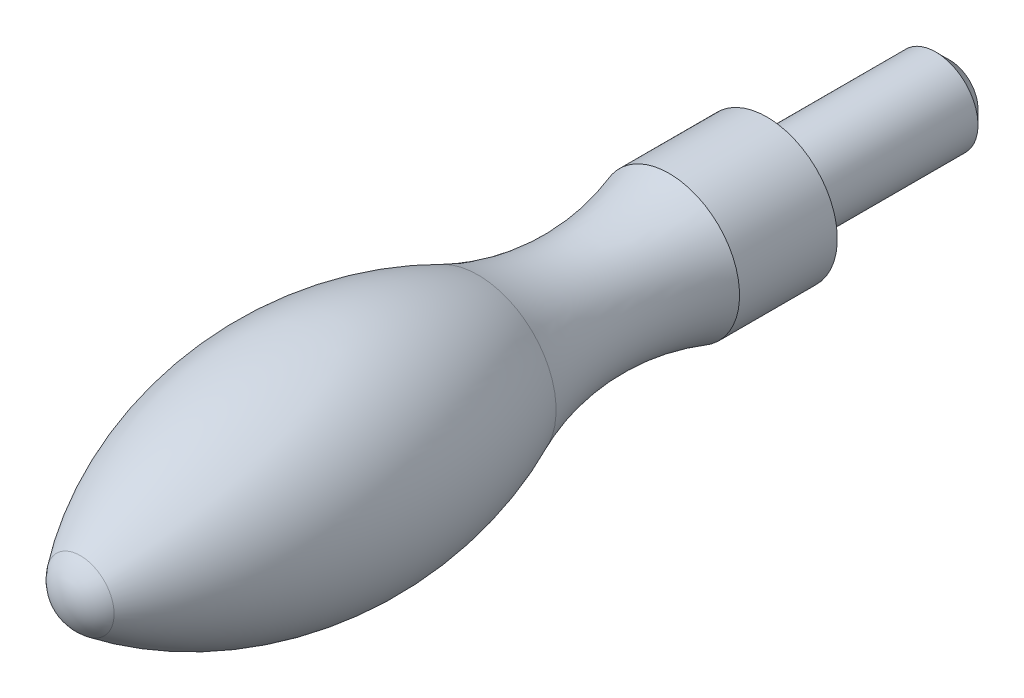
ISO-10303-21;
HEADER;
FILE_DESCRIPTION(('STEP AP214'),'2;1');
FILE_NAME('part.step','',(''),(''),'','','');
FILE_SCHEMA(('AUTOMOTIVE_DESIGN { 1 0 10303 214 1 1 1 1 }'));
ENDSEC;
DATA;
#1=APPLICATION_CONTEXT('core data for automotive mechanical design processes');
#2=APPLICATION_PROTOCOL_DEFINITION('international standard','automotive_design',2000,#1);
#3=PRODUCT_CONTEXT('',#1,'mechanical');
#4=PRODUCT('Part','Part','',(#3));
#5=PRODUCT_RELATED_PRODUCT_CATEGORY('part','',(#4));
#6=PRODUCT_DEFINITION_FORMATION('','',#4);
#7=PRODUCT_DEFINITION_CONTEXT('part definition',#1,'design');
#8=PRODUCT_DEFINITION('design','',#6,#7);
#9=PRODUCT_DEFINITION_SHAPE('','',#8);
#10=(LENGTH_UNIT() NAMED_UNIT(*) SI_UNIT(.MILLI.,.METRE.));
#11=(NAMED_UNIT(*) PLANE_ANGLE_UNIT() SI_UNIT($,.RADIAN.));
#12=(NAMED_UNIT(*) SI_UNIT($,.STERADIAN.) SOLID_ANGLE_UNIT());
#13=UNCERTAINTY_MEASURE_WITH_UNIT(LENGTH_MEASURE(1.E-05),#10,'distance_accuracy_value','');
#14=(GEOMETRIC_REPRESENTATION_CONTEXT(3) GLOBAL_UNCERTAINTY_ASSIGNED_CONTEXT((#13)) GLOBAL_UNIT_ASSIGNED_CONTEXT((#10,
#11,#12)) REPRESENTATION_CONTEXT('',''));
#15=CARTESIAN_POINT('',(0.,0.,0.));
#16=DIRECTION('',(0.,0.,1.));
#17=DIRECTION('',(1.,0.,0.));
#18=AXIS2_PLACEMENT_3D('',#15,#16,#17);
#19=CARTESIAN_POINT('',(0.,0.,47.));
#20=DIRECTION('',(-1.,0.,0.));
#21=DIRECTION('',(0.,0.,1.));
#22=AXIS2_PLACEMENT_3D('',#19,#20,#21);
#23=SPHERICAL_SURFACE('',#22,2.999999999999);
#24=CARTESIAN_POINT('',(0.,0.,47.));
#25=DIRECTION('',(0.,0.,-1.));
#26=DIRECTION('',(-1.,0.,0.));
#27=AXIS2_PLACEMENT_3D('',#24,#25,#26);
#28=SPHERICAL_SURFACE('',#27,2.999999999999);
#29=CARTESIAN_POINT('',(0.,0.,48.8000005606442));
#30=DIRECTION('',(0.,0.,-1.));
#31=DIRECTION('',(-1.,0.,0.));
#32=AXIS2_PLACEMENT_3D('',#29,#30,#31);
#33=CIRCLE('',#32,2.39999957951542);
#34=CARTESIAN_POINT('',(-2.39999957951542,0.,48.8000005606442));
#35=VERTEX_POINT('',#34);
#36=EDGE_CURVE('E23',#35,#35,#33,.T.);
#37=ORIENTED_EDGE('',*,*,#36,.F.);
#38=EDGE_LOOP('',(#37));
#39=FACE_BOUND('',#38,.T.);
#40=ADVANCED_FACE('F12',(#39),#28,.T.);
#41=CARTESIAN_POINT('',(0.,0.,32.));
#42=DIRECTION('',(0.,0.,-1.));
#43=DIRECTION('',(-1.,0.,0.));
#44=AXIS2_PLACEMENT_3D('',#41,#42,#43);
#45=DEGENERATE_TOROIDAL_SURFACE('',#44,20.0000000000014,28.,.F.);
#46=CARTESIAN_POINT('',(0.,0.,20.5311512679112));
#47=DIRECTION('',(0.,0.,-1.));
#48=DIRECTION('',(-1.,0.,0.));
#49=AXIS2_PLACEMENT_3D('',#46,#47,#48);
#50=CIRCLE('',#49,5.54340440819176);
#51=CARTESIAN_POINT('',(-5.54340440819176,0.,20.5311512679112));
#52=VERTEX_POINT('',#51);
#53=EDGE_CURVE('E27',#52,#52,#50,.T.);
#54=ORIENTED_EDGE('',*,*,#53,.F.);
#55=EDGE_LOOP('',(#54));
#56=FACE_BOUND('',#55,.T.);
#57=ORIENTED_EDGE('',*,*,#36,.T.);
#58=EDGE_LOOP('',(#57));
#59=FACE_BOUND('',#58,.T.);
#60=ADVANCED_FACE('F61',(#56,#59),#45,.F.);
#61=CARTESIAN_POINT('',(0.,0.,13.03));
#62=DIRECTION('',(0.,0.,-1.));
#63=DIRECTION('',(-1.,0.,0.));
#64=AXIS2_PLACEMENT_3D('',#61,#62,#63);
#65=TOROIDAL_SURFACE('',#64,23.,19.0000000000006);
#66=ORIENTED_EDGE('',*,*,#53,.T.);
#67=EDGE_LOOP('',(#66));
#68=FACE_BOUND('',#67,.T.);
#69=CARTESIAN_POINT('',(0.,0.,6.9472374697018));
#70=DIRECTION('',(0.,0.,-1.));
#71=DIRECTION('',(-1.,0.,0.));
#72=AXIS2_PLACEMENT_3D('',#69,#70,#71);
#73=CIRCLE('',#72,5.);
#74=CARTESIAN_POINT('',(-5.,0.,6.9472374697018));
#75=VERTEX_POINT('',#74);
#76=EDGE_CURVE('E32',#75,#75,#73,.T.);
#77=ORIENTED_EDGE('',*,*,#76,.F.);
#78=EDGE_LOOP('',(#77));
#79=FACE_BOUND('',#78,.T.);
#80=ADVANCED_FACE('F57',(#68,#79),#65,.F.);
#81=CARTESIAN_POINT('',(0.,0.,-15.5));
#82=DIRECTION('',(0.,0.,-1.));
#83=DIRECTION('',(-1.,0.,0.));
#84=AXIS2_PLACEMENT_3D('',#81,#82,#83);
#85=CYLINDRICAL_SURFACE('',#84,5.);
#86=CARTESIAN_POINT('',(0.,0.,0.));
#87=DIRECTION('',(0.,0.,-1.));
#88=DIRECTION('',(-1.,0.,0.));
#89=AXIS2_PLACEMENT_3D('',#86,#87,#88);
#90=CIRCLE('',#89,5.);
#91=CARTESIAN_POINT('',(-5.,0.,0.));
#92=VERTEX_POINT('',#91);
#93=EDGE_CURVE('E35',#92,#92,#90,.T.);
#94=ORIENTED_EDGE('',*,*,#93,.F.);
#95=EDGE_LOOP('',(#94));
#96=FACE_BOUND('',#95,.T.);
#97=ORIENTED_EDGE('',*,*,#76,.T.);
#98=EDGE_LOOP('',(#97));
#99=FACE_BOUND('',#98,.T.);
#100=ADVANCED_FACE('F46',(#96,#99),#85,.T.);
#101=CARTESIAN_POINT('',(0.,3.,0.));
#102=DIRECTION('',(0.,0.,-1.));
#103=DIRECTION('',(-1.,0.,0.));
#104=AXIS2_PLACEMENT_3D('',#101,#102,#103);
#105=PLANE('',#104);
#106=ORIENTED_EDGE('',*,*,#93,.T.);
#107=EDGE_LOOP('',(#106));
#108=FACE_BOUND('',#107,.T.);
#109=CARTESIAN_POINT('',(0.,0.,0.));
#110=DIRECTION('',(0.,0.,-1.));
#111=DIRECTION('',(-1.,0.,0.));
#112=AXIS2_PLACEMENT_3D('',#109,#110,#111);
#113=CIRCLE('',#112,3.);
#114=CARTESIAN_POINT('',(-3.,0.,0.));
#115=VERTEX_POINT('',#114);
#116=EDGE_CURVE('E38',#115,#115,#113,.T.);
#117=ORIENTED_EDGE('',*,*,#116,.F.);
#118=EDGE_LOOP('',(#117));
#119=FACE_BOUND('',#118,.T.);
#120=ADVANCED_FACE('F44',(#108,#119),#105,.T.);
#121=CARTESIAN_POINT('',(0.,0.,-15.5));
#122=DIRECTION('',(0.,0.,-1.));
#123=DIRECTION('',(-1.,0.,0.));
#124=AXIS2_PLACEMENT_3D('',#121,#122,#123);
#125=CYLINDRICAL_SURFACE('',#124,3.);
#126=CARTESIAN_POINT('',(0.,0.,-12.));
#127=DIRECTION('',(0.,0.,-1.));
#128=DIRECTION('',(-1.,0.,0.));
#129=AXIS2_PLACEMENT_3D('',#126,#127,#128);
#130=CIRCLE('',#129,3.);
#131=CARTESIAN_POINT('',(-3.,0.,-12.));
#132=VERTEX_POINT('',#131);
#133=EDGE_CURVE('E8',#132,#132,#130,.F.);
#134=ORIENTED_EDGE('',*,*,#133,.T.);
#135=EDGE_LOOP('',(#134));
#136=FACE_BOUND('',#135,.T.);
#137=ORIENTED_EDGE('',*,*,#116,.T.);
#138=EDGE_LOOP('',(#137));
#139=FACE_BOUND('',#138,.T.);
#140=ADVANCED_FACE('F42',(#136,#139),#125,.T.);
#141=CARTESIAN_POINT('',(0.,0.,-13.));
#142=DIRECTION('',(0.,0.,-1.));
#143=DIRECTION('',(-1.,0.,0.));
#144=AXIS2_PLACEMENT_3D('',#141,#142,#143);
#145=PLANE('',#144);
#146=CARTESIAN_POINT('',(0.,0.,-13.));
#147=DIRECTION('',(0.,0.,-1.));
#148=DIRECTION('',(-1.,0.,0.));
#149=AXIS2_PLACEMENT_3D('',#146,#147,#148);
#150=CIRCLE('',#149,2.);
#151=CARTESIAN_POINT('',(-2.,0.,-13.));
#152=VERTEX_POINT('',#151);
#153=EDGE_CURVE('E19',#152,#152,#150,.T.);
#154=ORIENTED_EDGE('',*,*,#153,.T.);
#155=EDGE_LOOP('',(#154));
#156=FACE_BOUND('',#155,.T.);
#157=ADVANCED_FACE('F55',(#156),#145,.T.);
#158=CARTESIAN_POINT('',(0.,0.,-13.));
#159=DIRECTION('',(0.,0.,1.));
#160=DIRECTION('',(1.,0.,0.));
#161=AXIS2_PLACEMENT_3D('',#158,#159,#160);
#162=CONICAL_SURFACE('',#161,2.,0.785398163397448);
#163=ORIENTED_EDGE('',*,*,#133,.F.);
#164=EDGE_LOOP('',(#163));
#165=FACE_BOUND('',#164,.T.);
#166=ORIENTED_EDGE('',*,*,#153,.F.);
#167=EDGE_LOOP('',(#166));
#168=FACE_BOUND('',#167,.T.);
#169=ADVANCED_FACE('F14',(#165,#168),#162,.T.);
#170=CLOSED_SHELL('',(#40,#60,#80,#100,#120,#140,#157,#169));
#171=MANIFOLD_SOLID_BREP('B1',#170);
#172=ADVANCED_BREP_SHAPE_REPRESENTATION('',(#18,#171),#14);
#173=SHAPE_DEFINITION_REPRESENTATION(#9,#172);
ENDSEC;
END-ISO-10303-21;
